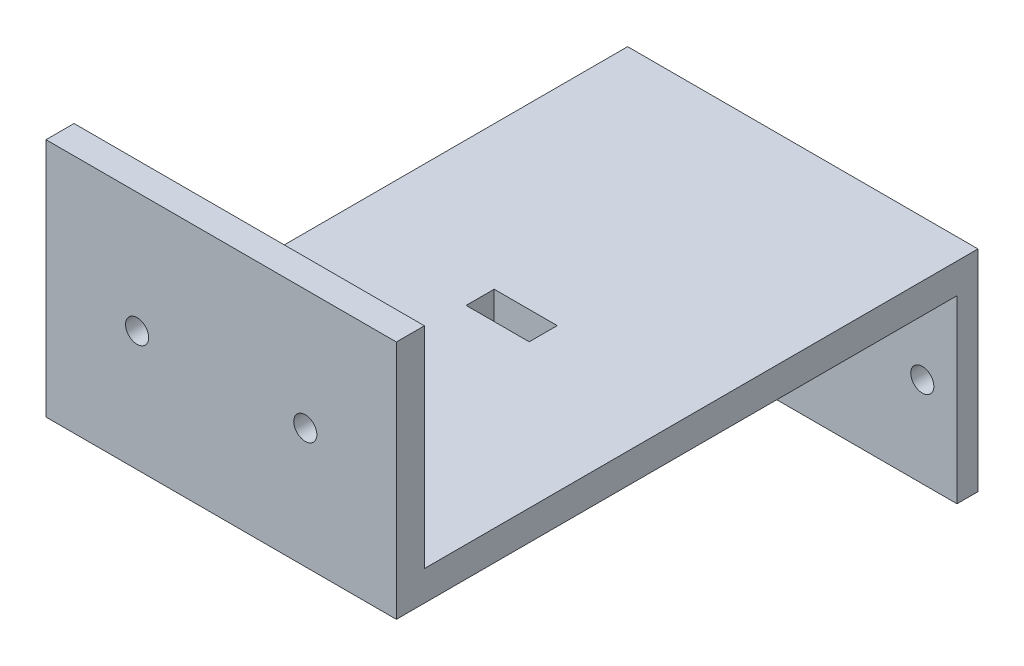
ISO-10303-21;
HEADER;
FILE_DESCRIPTION(('STEP AP214'),'2;1');
FILE_NAME('part.step','',(''),(''),'','','');
FILE_SCHEMA(('AUTOMOTIVE_DESIGN { 1 0 10303 214 1 1 1 1 }'));
ENDSEC;
DATA;
#1=APPLICATION_CONTEXT('core data for automotive mechanical design processes');
#2=APPLICATION_PROTOCOL_DEFINITION('international standard','automotive_design',2000,#1);
#3=PRODUCT_CONTEXT('',#1,'mechanical');
#4=PRODUCT('Part','Part','',(#3));
#5=PRODUCT_RELATED_PRODUCT_CATEGORY('part','',(#4));
#6=PRODUCT_DEFINITION_FORMATION('','',#4);
#7=PRODUCT_DEFINITION_CONTEXT('part definition',#1,'design');
#8=PRODUCT_DEFINITION('design','',#6,#7);
#9=PRODUCT_DEFINITION_SHAPE('','',#8);
#10=(LENGTH_UNIT() NAMED_UNIT(*) SI_UNIT(.MILLI.,.METRE.));
#11=(NAMED_UNIT(*) PLANE_ANGLE_UNIT() SI_UNIT($,.RADIAN.));
#12=(NAMED_UNIT(*) SI_UNIT($,.STERADIAN.) SOLID_ANGLE_UNIT());
#13=UNCERTAINTY_MEASURE_WITH_UNIT(LENGTH_MEASURE(1.E-05),#10,'distance_accuracy_value','');
#14=(GEOMETRIC_REPRESENTATION_CONTEXT(3) GLOBAL_UNCERTAINTY_ASSIGNED_CONTEXT((#13)) GLOBAL_UNIT_ASSIGNED_CONTEXT((#10,
#11,#12)) REPRESENTATION_CONTEXT('',''));
#15=CARTESIAN_POINT('',(0.,0.,0.));
#16=DIRECTION('',(0.,0.,1.));
#17=DIRECTION('',(1.,0.,0.));
#18=AXIS2_PLACEMENT_3D('',#15,#16,#17);
#19=CARTESIAN_POINT('',(-50.,30.,3.));
#20=DIRECTION('',(0.,-1.,0.));
#21=DIRECTION('',(0.,0.,-1.));
#22=AXIS2_PLACEMENT_3D('',#19,#20,#21);
#23=PLANE('',#22);
#24=DIRECTION('',(0.,0.,1.));
#25=VECTOR('',#24,1.);
#26=CARTESIAN_POINT('',(-29.5438540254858,30.,3.));
#27=LINE('',#26,#25);
#28=CARTESIAN_POINT('',(-29.5438540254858,30.,39.5));
#29=VERTEX_POINT('',#28);
#30=CARTESIAN_POINT('',(-29.5438540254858,30.,43.5));
#31=VERTEX_POINT('',#30);
#32=EDGE_CURVE('E238',#29,#31,#27,.T.);
#33=ORIENTED_EDGE('',*,*,#32,.F.);
#34=DIRECTION('',(-1.,0.,0.));
#35=VECTOR('',#34,1.);
#36=CARTESIAN_POINT('',(-50.,30.,39.5));
#37=LINE('',#36,#35);
#38=CARTESIAN_POINT('',(-20.5438540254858,30.,39.5));
#39=VERTEX_POINT('',#38);
#40=EDGE_CURVE('E195',#39,#29,#37,.T.);
#41=ORIENTED_EDGE('',*,*,#40,.F.);
#42=DIRECTION('',(0.,0.,1.));
#43=VECTOR('',#42,1.);
#44=CARTESIAN_POINT('',(-20.5438540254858,30.,3.));
#45=LINE('',#44,#43);
#46=CARTESIAN_POINT('',(-20.5438540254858,30.,43.5));
#47=VERTEX_POINT('',#46);
#48=EDGE_CURVE('E230',#39,#47,#45,.T.);
#49=ORIENTED_EDGE('',*,*,#48,.T.);
#50=DIRECTION('',(-1.,0.,0.));
#51=VECTOR('',#50,1.);
#52=CARTESIAN_POINT('',(-50.,30.,43.5));
#53=LINE('',#52,#51);
#54=EDGE_CURVE('E234',#47,#31,#53,.T.);
#55=ORIENTED_EDGE('',*,*,#54,.T.);
#56=EDGE_LOOP('',(#33,#41,#49,#55));
#57=FACE_BOUND('',#56,.T.);
#58=DIRECTION('',(-1.,0.,0.));
#59=VECTOR('',#58,1.);
#60=CARTESIAN_POINT('',(0.,30.,79.));
#61=LINE('',#60,#59);
#62=CARTESIAN_POINT('',(0.,30.,79.));
#63=VERTEX_POINT('',#62);
#64=CARTESIAN_POINT('',(-50.,30.,79.));
#65=VERTEX_POINT('',#64);
#66=EDGE_CURVE('E274',#63,#65,#61,.T.);
#67=ORIENTED_EDGE('',*,*,#66,.F.);
#68=DIRECTION('',(0.,0.,-1.));
#69=VECTOR('',#68,1.);
#70=CARTESIAN_POINT('',(0.,30.,3.));
#71=LINE('',#70,#69);
#72=CARTESIAN_POINT('',(0.,30.,0.));
#73=VERTEX_POINT('',#72);
#74=EDGE_CURVE('E11',#63,#73,#71,.T.);
#75=ORIENTED_EDGE('',*,*,#74,.T.);
#76=DIRECTION('',(-1.,0.,0.));
#77=VECTOR('',#76,1.);
#78=CARTESIAN_POINT('',(-50.,30.,0.));
#79=LINE('',#78,#77);
#80=CARTESIAN_POINT('',(-50.,30.,0.));
#81=VERTEX_POINT('',#80);
#82=EDGE_CURVE('E333',#73,#81,#79,.T.);
#83=ORIENTED_EDGE('',*,*,#82,.T.);
#84=DIRECTION('',(0.,0.,-1.));
#85=VECTOR('',#84,1.);
#86=CARTESIAN_POINT('',(-50.,30.,3.));
#87=LINE('',#86,#85);
#88=EDGE_CURVE('E55',#65,#81,#87,.T.);
#89=ORIENTED_EDGE('',*,*,#88,.F.);
#90=EDGE_LOOP('',(#67,#75,#83,#89));
#91=FACE_BOUND('',#90,.T.);
#92=DIRECTION('',(0.,0.,-1.));
#93=VECTOR('',#92,1.);
#94=CARTESIAN_POINT('',(-20.5438540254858,30.,3.));
#95=LINE('',#94,#93);
#96=CARTESIAN_POINT('',(-20.5438540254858,30.,74.338050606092));
#97=VERTEX_POINT('',#96);
#98=CARTESIAN_POINT('',(-20.5438540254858,30.,70.338050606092));
#99=VERTEX_POINT('',#98);
#100=EDGE_CURVE('E249',#97,#99,#95,.T.);
#101=ORIENTED_EDGE('',*,*,#100,.F.);
#102=DIRECTION('',(1.,0.,0.));
#103=VECTOR('',#102,1.);
#104=CARTESIAN_POINT('',(-50.,30.,74.338050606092));
#105=LINE('',#104,#103);
#106=CARTESIAN_POINT('',(-29.5438540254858,30.,74.338050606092));
#107=VERTEX_POINT('',#106);
#108=EDGE_CURVE('E240',#107,#97,#105,.T.);
#109=ORIENTED_EDGE('',*,*,#108,.F.);
#110=DIRECTION('',(0.,0.,-1.));
#111=VECTOR('',#110,1.);
#112=CARTESIAN_POINT('',(-29.5438540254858,30.,3.));
#113=LINE('',#112,#111);
#114=CARTESIAN_POINT('',(-29.5438540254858,30.,70.338050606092));
#115=VERTEX_POINT('',#114);
#116=EDGE_CURVE('E165',#107,#115,#113,.T.);
#117=ORIENTED_EDGE('',*,*,#116,.T.);
#118=DIRECTION('',(1.,0.,0.));
#119=VECTOR('',#118,1.);
#120=CARTESIAN_POINT('',(-50.,30.,70.338050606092));
#121=LINE('',#120,#119);
#122=EDGE_CURVE('E245',#115,#99,#121,.T.);
#123=ORIENTED_EDGE('',*,*,#122,.T.);
#124=EDGE_LOOP('',(#101,#109,#117,#123));
#125=FACE_BOUND('',#124,.T.);
#126=ADVANCED_FACE('F45',(#57,#91,#125),#23,.F.);
#127=CARTESIAN_POINT('',(0.,25.717337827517,83.));
#128=DIRECTION('',(0.,1.,0.));
#129=DIRECTION('',(0.,0.,1.));
#130=AXIS2_PLACEMENT_3D('',#127,#128,#129);
#131=PLANE('',#130);
#132=DIRECTION('',(0.,0.,1.));
#133=VECTOR('',#132,1.);
#134=CARTESIAN_POINT('',(-29.5438540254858,25.717337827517,0.));
#135=LINE('',#134,#133);
#136=CARTESIAN_POINT('',(-29.5438540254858,25.717337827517,39.5));
#137=VERTEX_POINT('',#136);
#138=CARTESIAN_POINT('',(-29.5438540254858,25.717337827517,43.5));
#139=VERTEX_POINT('',#138);
#140=EDGE_CURVE('E200',#137,#139,#135,.T.);
#141=ORIENTED_EDGE('',*,*,#140,.T.);
#142=DIRECTION('',(-1.,0.,0.));
#143=VECTOR('',#142,1.);
#144=CARTESIAN_POINT('',(0.,25.717337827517,43.5));
#145=LINE('',#144,#143);
#146=CARTESIAN_POINT('',(-20.5438540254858,25.717337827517,43.5));
#147=VERTEX_POINT('',#146);
#148=EDGE_CURVE('E212',#147,#139,#145,.T.);
#149=ORIENTED_EDGE('',*,*,#148,.F.);
#150=DIRECTION('',(0.,0.,1.));
#151=VECTOR('',#150,1.);
#152=CARTESIAN_POINT('',(-20.5438540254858,25.717337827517,0.));
#153=LINE('',#152,#151);
#154=CARTESIAN_POINT('',(-20.5438540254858,25.717337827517,39.5));
#155=VERTEX_POINT('',#154);
#156=EDGE_CURVE('E208',#155,#147,#153,.T.);
#157=ORIENTED_EDGE('',*,*,#156,.F.);
#158=DIRECTION('',(-1.,0.,0.));
#159=VECTOR('',#158,1.);
#160=CARTESIAN_POINT('',(0.,25.717337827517,39.5));
#161=LINE('',#160,#159);
#162=EDGE_CURVE('E204',#155,#137,#161,.T.);
#163=ORIENTED_EDGE('',*,*,#162,.T.);
#164=EDGE_LOOP('',(#141,#149,#157,#163));
#165=FACE_BOUND('',#164,.T.);
#166=DIRECTION('',(1.,0.,0.));
#167=VECTOR('',#166,1.);
#168=CARTESIAN_POINT('',(0.,25.717337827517,3.));
#169=LINE('',#168,#167);
#170=CARTESIAN_POINT('',(-50.,25.717337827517,3.));
#171=VERTEX_POINT('',#170);
#172=CARTESIAN_POINT('',(0.,25.717337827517,3.));
#173=VERTEX_POINT('',#172);
#174=EDGE_CURVE('E296',#171,#173,#169,.T.);
#175=ORIENTED_EDGE('',*,*,#174,.T.);
#176=DIRECTION('',(0.,0.,-1.));
#177=VECTOR('',#176,1.);
#178=CARTESIAN_POINT('',(0.,25.717337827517,83.));
#179=LINE('',#178,#177);
#180=CARTESIAN_POINT('',(0.,25.717337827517,83.));
#181=VERTEX_POINT('',#180);
#182=EDGE_CURVE('E307',#181,#173,#179,.T.);
#183=ORIENTED_EDGE('',*,*,#182,.F.);
#184=DIRECTION('',(1.,0.,0.));
#185=VECTOR('',#184,1.);
#186=CARTESIAN_POINT('',(0.,25.717337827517,83.));
#187=LINE('',#186,#185);
#188=CARTESIAN_POINT('',(-50.,25.717337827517,83.));
#189=VERTEX_POINT('',#188);
#190=EDGE_CURVE('E301',#189,#181,#187,.T.);
#191=ORIENTED_EDGE('',*,*,#190,.F.);
#192=DIRECTION('',(0.,0.,-1.));
#193=VECTOR('',#192,1.);
#194=CARTESIAN_POINT('',(-50.,25.717337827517,83.));
#195=LINE('',#194,#193);
#196=EDGE_CURVE('E314',#189,#171,#195,.T.);
#197=ORIENTED_EDGE('',*,*,#196,.T.);
#198=EDGE_LOOP('',(#175,#183,#191,#197));
#199=FACE_BOUND('',#198,.T.);
#200=DIRECTION('',(0.,0.,-1.));
#201=VECTOR('',#200,1.);
#202=CARTESIAN_POINT('',(-20.5438540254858,25.717337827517,0.));
#203=LINE('',#202,#201);
#204=CARTESIAN_POINT('',(-20.5438540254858,25.717337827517,74.338050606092));
#205=VERTEX_POINT('',#204);
#206=CARTESIAN_POINT('',(-20.5438540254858,25.717337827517,70.338050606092));
#207=VERTEX_POINT('',#206);
#208=EDGE_CURVE('E179',#205,#207,#203,.T.);
#209=ORIENTED_EDGE('',*,*,#208,.T.);
#210=DIRECTION('',(1.,0.,0.));
#211=VECTOR('',#210,1.);
#212=CARTESIAN_POINT('',(0.,25.717337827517,70.338050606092));
#213=LINE('',#212,#211);
#214=CARTESIAN_POINT('',(-29.5438540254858,25.717337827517,70.338050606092));
#215=VERTEX_POINT('',#214);
#216=EDGE_CURVE('E183',#215,#207,#213,.T.);
#217=ORIENTED_EDGE('',*,*,#216,.F.);
#218=DIRECTION('',(0.,0.,-1.));
#219=VECTOR('',#218,1.);
#220=CARTESIAN_POINT('',(-29.5438540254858,25.717337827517,0.));
#221=LINE('',#220,#219);
#222=CARTESIAN_POINT('',(-29.5438540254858,25.717337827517,74.338050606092));
#223=VERTEX_POINT('',#222);
#224=EDGE_CURVE('E162',#223,#215,#221,.T.);
#225=ORIENTED_EDGE('',*,*,#224,.F.);
#226=DIRECTION('',(1.,0.,0.));
#227=VECTOR('',#226,1.);
#228=CARTESIAN_POINT('',(0.,25.717337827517,74.338050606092));
#229=LINE('',#228,#227);
#230=EDGE_CURVE('E173',#223,#205,#229,.T.);
#231=ORIENTED_EDGE('',*,*,#230,.T.);
#232=EDGE_LOOP('',(#209,#217,#225,#231));
#233=FACE_BOUND('',#232,.T.);
#234=ADVANCED_FACE('F181',(#165,#199,#233),#131,.F.);
#235=CARTESIAN_POINT('',(0.,0.,3.));
#236=DIRECTION('',(0.,0.,-1.));
#237=DIRECTION('',(-1.,0.,0.));
#238=AXIS2_PLACEMENT_3D('',#235,#236,#237);
#239=PLANE('',#238);
#240=CARTESIAN_POINT('',(-45.05,12.8586689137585,3.));
#241=DIRECTION('',(0.,0.,1.));
#242=DIRECTION('',(1.,0.,0.));
#243=AXIS2_PLACEMENT_3D('',#240,#241,#242);
#244=CIRCLE('',#243,1.65);
#245=CARTESIAN_POINT('',(-43.4,12.8586689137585,3.));
#246=VERTEX_POINT('',#245);
#247=EDGE_CURVE('E260',#246,#246,#244,.T.);
#248=ORIENTED_EDGE('',*,*,#247,.F.);
#249=EDGE_LOOP('',(#248));
#250=FACE_BOUND('',#249,.T.);
#251=CARTESIAN_POINT('',(-4.95,12.8586689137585,3.));
#252=DIRECTION('',(0.,0.,1.));
#253=DIRECTION('',(-1.,0.,0.));
#254=AXIS2_PLACEMENT_3D('',#251,#252,#253);
#255=CIRCLE('',#254,1.65);
#256=CARTESIAN_POINT('',(-6.6,12.8586689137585,3.));
#257=VERTEX_POINT('',#256);
#258=EDGE_CURVE('E265',#257,#257,#255,.T.);
#259=ORIENTED_EDGE('',*,*,#258,.F.);
#260=EDGE_LOOP('',(#259));
#261=FACE_BOUND('',#260,.T.);
#262=ORIENTED_EDGE('',*,*,#174,.F.);
#263=DIRECTION('',(0.,-1.,0.));
#264=VECTOR('',#263,1.);
#265=CARTESIAN_POINT('',(-50.,0.,3.));
#266=LINE('',#265,#264);
#267=CARTESIAN_POINT('',(-50.,0.,3.));
#268=VERTEX_POINT('',#267);
#269=EDGE_CURVE('E322',#171,#268,#266,.T.);
#270=ORIENTED_EDGE('',*,*,#269,.T.);
#271=DIRECTION('',(1.,0.,0.));
#272=VECTOR('',#271,1.);
#273=CARTESIAN_POINT('',(0.,0.,3.));
#274=LINE('',#273,#272);
#275=CARTESIAN_POINT('',(0.,0.,3.));
#276=VERTEX_POINT('',#275);
#277=EDGE_CURVE('E326',#268,#276,#274,.T.);
#278=ORIENTED_EDGE('',*,*,#277,.T.);
#279=DIRECTION('',(0.,1.,0.));
#280=VECTOR('',#279,1.);
#281=CARTESIAN_POINT('',(0.,30.,3.));
#282=LINE('',#281,#280);
#283=EDGE_CURVE('E319',#276,#173,#282,.T.);
#284=ORIENTED_EDGE('',*,*,#283,.T.);
#285=EDGE_LOOP('',(#262,#270,#278,#284));
#286=FACE_BOUND('',#285,.T.);
#287=ADVANCED_FACE('F385',(#250,#261,#286),#239,.F.);
#288=CARTESIAN_POINT('',(0.,30.,3.));
#289=DIRECTION('',(-1.,0.,0.));
#290=DIRECTION('',(0.,0.,1.));
#291=AXIS2_PLACEMENT_3D('',#288,#289,#290);
#292=PLANE('',#291);
#293=DIRECTION('',(0.,1.,0.));
#294=VECTOR('',#293,1.);
#295=CARTESIAN_POINT('',(0.,30.,0.));
#296=LINE('',#295,#294);
#297=CARTESIAN_POINT('',(0.,0.,0.));
#298=VERTEX_POINT('',#297);
#299=EDGE_CURVE('E318',#298,#73,#296,.T.);
#300=ORIENTED_EDGE('',*,*,#299,.T.);
#301=ORIENTED_EDGE('',*,*,#74,.F.);
#302=DIRECTION('',(0.,-1.,0.));
#303=VECTOR('',#302,1.);
#304=CARTESIAN_POINT('',(0.,60.,79.));
#305=LINE('',#304,#303);
#306=CARTESIAN_POINT('',(0.,60.,79.));
#307=VERTEX_POINT('',#306);
#308=EDGE_CURVE('E292',#307,#63,#305,.T.);
#309=ORIENTED_EDGE('',*,*,#308,.F.);
#310=DIRECTION('',(0.,0.,-1.));
#311=VECTOR('',#310,1.);
#312=CARTESIAN_POINT('',(0.,60.,83.));
#313=LINE('',#312,#311);
#314=CARTESIAN_POINT('',(0.,60.,83.));
#315=VERTEX_POINT('',#314);
#316=EDGE_CURVE('E278',#315,#307,#313,.T.);
#317=ORIENTED_EDGE('',*,*,#316,.F.);
#318=DIRECTION('',(0.,1.,0.));
#319=VECTOR('',#318,1.);
#320=CARTESIAN_POINT('',(0.,30.,83.));
#321=LINE('',#320,#319);
#322=EDGE_CURVE('E304',#181,#315,#321,.T.);
#323=ORIENTED_EDGE('',*,*,#322,.F.);
#324=ORIENTED_EDGE('',*,*,#182,.T.);
#325=ORIENTED_EDGE('',*,*,#283,.F.);
#326=DIRECTION('',(0.,0.,-1.));
#327=VECTOR('',#326,1.);
#328=CARTESIAN_POINT('',(0.,0.,3.));
#329=LINE('',#328,#327);
#330=EDGE_CURVE('E329',#276,#298,#329,.T.);
#331=ORIENTED_EDGE('',*,*,#330,.T.);
#332=EDGE_LOOP('',(#300,#301,#309,#317,#323,#324,#325,#331));
#333=FACE_BOUND('',#332,.T.);
#334=ADVANCED_FACE('F47',(#333),#292,.F.);
#335=CARTESIAN_POINT('',(-50.,0.,3.));
#336=DIRECTION('',(1.,0.,0.));
#337=DIRECTION('',(0.,0.,-1.));
#338=AXIS2_PLACEMENT_3D('',#335,#336,#337);
#339=PLANE('',#338);
#340=DIRECTION('',(0.,-1.,0.));
#341=VECTOR('',#340,1.);
#342=CARTESIAN_POINT('',(-50.,0.,0.));
#343=LINE('',#342,#341);
#344=CARTESIAN_POINT('',(-50.,0.,0.));
#345=VERTEX_POINT('',#344);
#346=EDGE_CURVE('E337',#81,#345,#343,.T.);
#347=ORIENTED_EDGE('',*,*,#346,.T.);
#348=DIRECTION('',(0.,0.,-1.));
#349=VECTOR('',#348,1.);
#350=CARTESIAN_POINT('',(-50.,0.,3.));
#351=LINE('',#350,#349);
#352=EDGE_CURVE('E345',#268,#345,#351,.T.);
#353=ORIENTED_EDGE('',*,*,#352,.F.);
#354=ORIENTED_EDGE('',*,*,#269,.F.);
#355=ORIENTED_EDGE('',*,*,#196,.F.);
#356=DIRECTION('',(0.,-1.,0.));
#357=VECTOR('',#356,1.);
#358=CARTESIAN_POINT('',(-50.,25.717337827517,83.));
#359=LINE('',#358,#357);
#360=CARTESIAN_POINT('',(-50.,60.,83.));
#361=VERTEX_POINT('',#360);
#362=EDGE_CURVE('E297',#361,#189,#359,.T.);
#363=ORIENTED_EDGE('',*,*,#362,.F.);
#364=DIRECTION('',(0.,0.,1.));
#365=VECTOR('',#364,1.);
#366=CARTESIAN_POINT('',(-50.,60.,79.));
#367=LINE('',#366,#365);
#368=CARTESIAN_POINT('',(-50.,60.,79.));
#369=VERTEX_POINT('',#368);
#370=EDGE_CURVE('E269',#369,#361,#367,.T.);
#371=ORIENTED_EDGE('',*,*,#370,.F.);
#372=DIRECTION('',(0.,-1.,0.));
#373=VECTOR('',#372,1.);
#374=CARTESIAN_POINT('',(-50.,60.,79.));
#375=LINE('',#374,#373);
#376=EDGE_CURVE('E284',#369,#65,#375,.T.);
#377=ORIENTED_EDGE('',*,*,#376,.T.);
#378=ORIENTED_EDGE('',*,*,#88,.T.);
#379=EDGE_LOOP('',(#347,#353,#354,#355,#363,#371,#377,#378));
#380=FACE_BOUND('',#379,.T.);
#381=ADVANCED_FACE('F391',(#380),#339,.F.);
#382=CARTESIAN_POINT('',(0.,0.,3.));
#383=DIRECTION('',(0.,1.,0.));
#384=DIRECTION('',(0.,0.,1.));
#385=AXIS2_PLACEMENT_3D('',#382,#383,#384);
#386=PLANE('',#385);
#387=DIRECTION('',(1.,0.,0.));
#388=VECTOR('',#387,1.);
#389=CARTESIAN_POINT('',(0.,0.,0.));
#390=LINE('',#389,#388);
#391=EDGE_CURVE('E323',#345,#298,#390,.T.);
#392=ORIENTED_EDGE('',*,*,#391,.T.);
#393=ORIENTED_EDGE('',*,*,#330,.F.);
#394=ORIENTED_EDGE('',*,*,#277,.F.);
#395=ORIENTED_EDGE('',*,*,#352,.T.);
#396=EDGE_LOOP('',(#392,#393,#394,#395));
#397=FACE_BOUND('',#396,.T.);
#398=ADVANCED_FACE('F394',(#397),#386,.F.);
#399=CARTESIAN_POINT('',(0.,0.,0.));
#400=DIRECTION('',(0.,0.,-1.));
#401=DIRECTION('',(-1.,0.,0.));
#402=AXIS2_PLACEMENT_3D('',#399,#400,#401);
#403=PLANE('',#402);
#404=CARTESIAN_POINT('',(-45.05,12.8586689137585,0.));
#405=DIRECTION('',(0.,0.,-1.));
#406=DIRECTION('',(-1.,0.,0.));
#407=AXIS2_PLACEMENT_3D('',#404,#405,#406);
#408=CIRCLE('',#407,1.65);
#409=CARTESIAN_POINT('',(-46.7,12.8586689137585,0.));
#410=VERTEX_POINT('',#409);
#411=EDGE_CURVE('E288',#410,#410,#408,.T.);
#412=ORIENTED_EDGE('',*,*,#411,.F.);
#413=EDGE_LOOP('',(#412));
#414=FACE_BOUND('',#413,.T.);
#415=CARTESIAN_POINT('',(-4.95,12.8586689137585,0.));
#416=DIRECTION('',(0.,0.,-1.));
#417=DIRECTION('',(-1.,0.,0.));
#418=AXIS2_PLACEMENT_3D('',#415,#416,#417);
#419=CIRCLE('',#418,1.65);
#420=CARTESIAN_POINT('',(-6.6,12.8586689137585,0.));
#421=VERTEX_POINT('',#420);
#422=EDGE_CURVE('E264',#421,#421,#419,.T.);
#423=ORIENTED_EDGE('',*,*,#422,.F.);
#424=EDGE_LOOP('',(#423));
#425=FACE_BOUND('',#424,.T.);
#426=ORIENTED_EDGE('',*,*,#299,.F.);
#427=ORIENTED_EDGE('',*,*,#391,.F.);
#428=ORIENTED_EDGE('',*,*,#346,.F.);
#429=ORIENTED_EDGE('',*,*,#82,.F.);
#430=EDGE_LOOP('',(#426,#427,#428,#429));
#431=FACE_BOUND('',#430,.T.);
#432=ADVANCED_FACE('F398',(#414,#425,#431),#403,.T.);
#433=CARTESIAN_POINT('',(0.,0.,83.));
#434=DIRECTION('',(0.,0.,-1.));
#435=DIRECTION('',(-1.,0.,0.));
#436=AXIS2_PLACEMENT_3D('',#433,#434,#435);
#437=PLANE('',#436);
#438=CARTESIAN_POINT('',(-37.,42.8586689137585,83.));
#439=DIRECTION('',(0.,0.,1.));
#440=DIRECTION('',(1.,0.,0.));
#441=AXIS2_PLACEMENT_3D('',#438,#439,#440);
#442=CIRCLE('',#441,1.65);
#443=CARTESIAN_POINT('',(-35.35,42.8586689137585,83.));
#444=VERTEX_POINT('',#443);
#445=EDGE_CURVE('E252',#444,#444,#442,.T.);
#446=ORIENTED_EDGE('',*,*,#445,.F.);
#447=EDGE_LOOP('',(#446));
#448=FACE_BOUND('',#447,.T.);
#449=CARTESIAN_POINT('',(-13.,42.8586689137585,83.));
#450=DIRECTION('',(0.,0.,1.));
#451=DIRECTION('',(-1.,0.,0.));
#452=AXIS2_PLACEMENT_3D('',#449,#450,#451);
#453=CIRCLE('',#452,1.65);
#454=CARTESIAN_POINT('',(-14.65,42.8586689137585,83.));
#455=VERTEX_POINT('',#454);
#456=EDGE_CURVE('E251',#455,#455,#453,.T.);
#457=ORIENTED_EDGE('',*,*,#456,.F.);
#458=EDGE_LOOP('',(#457));
#459=FACE_BOUND('',#458,.T.);
#460=ORIENTED_EDGE('',*,*,#362,.T.);
#461=ORIENTED_EDGE('',*,*,#190,.T.);
#462=ORIENTED_EDGE('',*,*,#322,.T.);
#463=DIRECTION('',(1.,0.,0.));
#464=VECTOR('',#463,1.);
#465=CARTESIAN_POINT('',(-50.,60.,83.));
#466=LINE('',#465,#464);
#467=EDGE_CURVE('E273',#361,#315,#466,.T.);
#468=ORIENTED_EDGE('',*,*,#467,.F.);
#469=EDGE_LOOP('',(#460,#461,#462,#468));
#470=FACE_BOUND('',#469,.T.);
#471=ADVANCED_FACE('F402',(#448,#459,#470),#437,.F.);
#472=CARTESIAN_POINT('',(0.,60.,79.));
#473=DIRECTION('',(0.,0.,1.));
#474=DIRECTION('',(1.,0.,0.));
#475=AXIS2_PLACEMENT_3D('',#472,#473,#474);
#476=PLANE('',#475);
#477=CARTESIAN_POINT('',(-37.,42.8586689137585,79.));
#478=DIRECTION('',(0.,0.,1.));
#479=DIRECTION('',(1.,0.,0.));
#480=AXIS2_PLACEMENT_3D('',#477,#478,#479);
#481=CIRCLE('',#480,1.65);
#482=CARTESIAN_POINT('',(-35.35,42.8586689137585,79.));
#483=VERTEX_POINT('',#482);
#484=EDGE_CURVE('E49',#483,#483,#481,.T.);
#485=ORIENTED_EDGE('',*,*,#484,.T.);
#486=EDGE_LOOP('',(#485));
#487=FACE_BOUND('',#486,.T.);
#488=CARTESIAN_POINT('',(-13.,42.8586689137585,79.));
#489=DIRECTION('',(0.,0.,1.));
#490=DIRECTION('',(1.,0.,0.));
#491=AXIS2_PLACEMENT_3D('',#488,#489,#490);
#492=CIRCLE('',#491,1.65);
#493=CARTESIAN_POINT('',(-11.35,42.8586689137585,79.));
#494=VERTEX_POINT('',#493);
#495=EDGE_CURVE('E256',#494,#494,#492,.T.);
#496=ORIENTED_EDGE('',*,*,#495,.T.);
#497=EDGE_LOOP('',(#496));
#498=FACE_BOUND('',#497,.T.);
#499=ORIENTED_EDGE('',*,*,#66,.T.);
#500=ORIENTED_EDGE('',*,*,#376,.F.);
#501=DIRECTION('',(-1.,0.,0.));
#502=VECTOR('',#501,1.);
#503=CARTESIAN_POINT('',(0.,60.,79.));
#504=LINE('',#503,#502);
#505=EDGE_CURVE('E281',#307,#369,#504,.T.);
#506=ORIENTED_EDGE('',*,*,#505,.F.);
#507=ORIENTED_EDGE('',*,*,#308,.T.);
#508=EDGE_LOOP('',(#499,#500,#506,#507));
#509=FACE_BOUND('',#508,.T.);
#510=ADVANCED_FACE('F364',(#487,#498,#509),#476,.F.);
#511=CARTESIAN_POINT('',(0.,60.,0.));
#512=DIRECTION('',(0.,1.,0.));
#513=DIRECTION('',(0.,0.,1.));
#514=AXIS2_PLACEMENT_3D('',#511,#512,#513);
#515=PLANE('',#514);
#516=ORIENTED_EDGE('',*,*,#370,.T.);
#517=ORIENTED_EDGE('',*,*,#467,.T.);
#518=ORIENTED_EDGE('',*,*,#316,.T.);
#519=ORIENTED_EDGE('',*,*,#505,.T.);
#520=EDGE_LOOP('',(#516,#517,#518,#519));
#521=FACE_BOUND('',#520,.T.);
#522=ADVANCED_FACE('F412',(#521),#515,.T.);
#523=CARTESIAN_POINT('',(-4.95,12.8586689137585,-27.));
#524=DIRECTION('',(0.,0.,1.));
#525=DIRECTION('',(1.,0.,0.));
#526=AXIS2_PLACEMENT_3D('',#523,#524,#525);
#527=CYLINDRICAL_SURFACE('',#526,1.65);
#528=ORIENTED_EDGE('',*,*,#422,.T.);
#529=EDGE_LOOP('',(#528));
#530=FACE_BOUND('',#529,.T.);
#531=ORIENTED_EDGE('',*,*,#258,.T.);
#532=EDGE_LOOP('',(#531));
#533=FACE_BOUND('',#532,.T.);
#534=ADVANCED_FACE('F415',(#530,#533),#527,.F.);
#535=CARTESIAN_POINT('',(-45.05,12.8586689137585,-27.));
#536=DIRECTION('',(0.,0.,1.));
#537=DIRECTION('',(1.,0.,0.));
#538=AXIS2_PLACEMENT_3D('',#535,#536,#537);
#539=CYLINDRICAL_SURFACE('',#538,1.65);
#540=ORIENTED_EDGE('',*,*,#411,.T.);
#541=EDGE_LOOP('',(#540));
#542=FACE_BOUND('',#541,.T.);
#543=ORIENTED_EDGE('',*,*,#247,.T.);
#544=EDGE_LOOP('',(#543));
#545=FACE_BOUND('',#544,.T.);
#546=ADVANCED_FACE('F378',(#542,#545),#539,.F.);
#547=CARTESIAN_POINT('',(-13.,42.8586689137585,53.));
#548=DIRECTION('',(0.,0.,1.));
#549=DIRECTION('',(1.,0.,0.));
#550=AXIS2_PLACEMENT_3D('',#547,#548,#549);
#551=CYLINDRICAL_SURFACE('',#550,1.65);
#552=ORIENTED_EDGE('',*,*,#456,.T.);
#553=EDGE_LOOP('',(#552));
#554=FACE_BOUND('',#553,.T.);
#555=ORIENTED_EDGE('',*,*,#495,.F.);
#556=EDGE_LOOP('',(#555));
#557=FACE_BOUND('',#556,.T.);
#558=ADVANCED_FACE('F369',(#554,#557),#551,.F.);
#559=CARTESIAN_POINT('',(-37.,42.8586689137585,53.));
#560=DIRECTION('',(0.,0.,1.));
#561=DIRECTION('',(1.,0.,0.));
#562=AXIS2_PLACEMENT_3D('',#559,#560,#561);
#563=CYLINDRICAL_SURFACE('',#562,1.65);
#564=ORIENTED_EDGE('',*,*,#445,.T.);
#565=EDGE_LOOP('',(#564));
#566=FACE_BOUND('',#565,.T.);
#567=ORIENTED_EDGE('',*,*,#484,.F.);
#568=EDGE_LOOP('',(#567));
#569=FACE_BOUND('',#568,.T.);
#570=ADVANCED_FACE('F366',(#566,#569),#563,.F.);
#571=CARTESIAN_POINT('',(-29.5438540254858,35.717337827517,0.));
#572=DIRECTION('',(1.,0.,0.));
#573=DIRECTION('',(0.,0.,-1.));
#574=AXIS2_PLACEMENT_3D('',#571,#572,#573);
#575=PLANE('',#574);
#576=ORIENTED_EDGE('',*,*,#32,.T.);
#577=DIRECTION('',(0.,-1.,0.));
#578=VECTOR('',#577,1.);
#579=CARTESIAN_POINT('',(-29.5438540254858,35.717337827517,43.5));
#580=LINE('',#579,#578);
#581=EDGE_CURVE('E217',#31,#139,#580,.T.);
#582=ORIENTED_EDGE('',*,*,#581,.T.);
#583=ORIENTED_EDGE('',*,*,#140,.F.);
#584=DIRECTION('',(0.,-1.,0.));
#585=VECTOR('',#584,1.);
#586=CARTESIAN_POINT('',(-29.5438540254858,35.717337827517,39.5));
#587=LINE('',#586,#585);
#588=EDGE_CURVE('E216',#29,#137,#587,.T.);
#589=ORIENTED_EDGE('',*,*,#588,.F.);
#590=EDGE_LOOP('',(#576,#582,#583,#589));
#591=FACE_BOUND('',#590,.T.);
#592=ADVANCED_FACE('F368',(#591),#575,.T.);
#593=CARTESIAN_POINT('',(0.,35.717337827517,43.5));
#594=DIRECTION('',(0.,0.,1.));
#595=DIRECTION('',(1.,0.,0.));
#596=AXIS2_PLACEMENT_3D('',#593,#594,#595);
#597=PLANE('',#596);
#598=DIRECTION('',(0.,-1.,0.));
#599=VECTOR('',#598,1.);
#600=CARTESIAN_POINT('',(-20.5438540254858,35.717337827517,43.5));
#601=LINE('',#600,#599);
#602=EDGE_CURVE('E220',#47,#147,#601,.T.);
#603=ORIENTED_EDGE('',*,*,#602,.T.);
#604=ORIENTED_EDGE('',*,*,#148,.T.);
#605=ORIENTED_EDGE('',*,*,#581,.F.);
#606=ORIENTED_EDGE('',*,*,#54,.F.);
#607=EDGE_LOOP('',(#603,#604,#605,#606));
#608=FACE_BOUND('',#607,.T.);
#609=ADVANCED_FACE('F375',(#608),#597,.F.);
#610=CARTESIAN_POINT('',(-20.5438540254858,35.717337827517,0.));
#611=DIRECTION('',(1.,0.,0.));
#612=DIRECTION('',(0.,0.,-1.));
#613=AXIS2_PLACEMENT_3D('',#610,#611,#612);
#614=PLANE('',#613);
#615=DIRECTION('',(0.,-1.,0.));
#616=VECTOR('',#615,1.);
#617=CARTESIAN_POINT('',(-20.5438540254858,35.717337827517,39.5));
#618=LINE('',#617,#616);
#619=EDGE_CURVE('E71',#39,#155,#618,.T.);
#620=ORIENTED_EDGE('',*,*,#619,.T.);
#621=ORIENTED_EDGE('',*,*,#156,.T.);
#622=ORIENTED_EDGE('',*,*,#602,.F.);
#623=ORIENTED_EDGE('',*,*,#48,.F.);
#624=EDGE_LOOP('',(#620,#621,#622,#623));
#625=FACE_BOUND('',#624,.T.);
#626=ADVANCED_FACE('F531',(#625),#614,.F.);
#627=CARTESIAN_POINT('',(0.,35.717337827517,39.5));
#628=DIRECTION('',(0.,0.,1.));
#629=DIRECTION('',(1.,0.,0.));
#630=AXIS2_PLACEMENT_3D('',#627,#628,#629);
#631=PLANE('',#630);
#632=ORIENTED_EDGE('',*,*,#40,.T.);
#633=ORIENTED_EDGE('',*,*,#588,.T.);
#634=ORIENTED_EDGE('',*,*,#162,.F.);
#635=ORIENTED_EDGE('',*,*,#619,.F.);
#636=EDGE_LOOP('',(#632,#633,#634,#635));
#637=FACE_BOUND('',#636,.T.);
#638=ADVANCED_FACE('F542',(#637),#631,.T.);
#639=CARTESIAN_POINT('',(-20.5438540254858,35.717337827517,0.));
#640=DIRECTION('',(-1.,0.,0.));
#641=DIRECTION('',(0.,0.,1.));
#642=AXIS2_PLACEMENT_3D('',#639,#640,#641);
#643=PLANE('',#642);
#644=ORIENTED_EDGE('',*,*,#100,.T.);
#645=DIRECTION('',(0.,-1.,0.));
#646=VECTOR('',#645,1.);
#647=CARTESIAN_POINT('',(-20.5438540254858,35.717337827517,70.338050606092));
#648=LINE('',#647,#646);
#649=EDGE_CURVE('E192',#99,#207,#648,.T.);
#650=ORIENTED_EDGE('',*,*,#649,.T.);
#651=ORIENTED_EDGE('',*,*,#208,.F.);
#652=DIRECTION('',(0.,-1.,0.));
#653=VECTOR('',#652,1.);
#654=CARTESIAN_POINT('',(-20.5438540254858,35.717337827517,74.338050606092));
#655=LINE('',#654,#653);
#656=EDGE_CURVE('E169',#97,#205,#655,.T.);
#657=ORIENTED_EDGE('',*,*,#656,.F.);
#658=EDGE_LOOP('',(#644,#650,#651,#657));
#659=FACE_BOUND('',#658,.T.);
#660=ADVANCED_FACE('F553',(#659),#643,.T.);
#661=CARTESIAN_POINT('',(0.,35.717337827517,70.338050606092));
#662=DIRECTION('',(0.,0.,-1.));
#663=DIRECTION('',(-1.,0.,0.));
#664=AXIS2_PLACEMENT_3D('',#661,#662,#663);
#665=PLANE('',#664);
#666=DIRECTION('',(0.,-1.,0.));
#667=VECTOR('',#666,1.);
#668=CARTESIAN_POINT('',(-29.5438540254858,35.717337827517,70.338050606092));
#669=LINE('',#668,#667);
#670=EDGE_CURVE('E168',#115,#215,#669,.T.);
#671=ORIENTED_EDGE('',*,*,#670,.T.);
#672=ORIENTED_EDGE('',*,*,#216,.T.);
#673=ORIENTED_EDGE('',*,*,#649,.F.);
#674=ORIENTED_EDGE('',*,*,#122,.F.);
#675=EDGE_LOOP('',(#671,#672,#673,#674));
#676=FACE_BOUND('',#675,.T.);
#677=ADVANCED_FACE('F563',(#676),#665,.F.);
#678=CARTESIAN_POINT('',(-29.5438540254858,35.717337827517,0.));
#679=DIRECTION('',(-1.,0.,0.));
#680=DIRECTION('',(0.,0.,1.));
#681=AXIS2_PLACEMENT_3D('',#678,#679,#680);
#682=PLANE('',#681);
#683=DIRECTION('',(0.,-1.,0.));
#684=VECTOR('',#683,1.);
#685=CARTESIAN_POINT('',(-29.5438540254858,35.717337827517,74.338050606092));
#686=LINE('',#685,#684);
#687=EDGE_CURVE('E63',#107,#223,#686,.T.);
#688=ORIENTED_EDGE('',*,*,#687,.T.);
#689=ORIENTED_EDGE('',*,*,#224,.T.);
#690=ORIENTED_EDGE('',*,*,#670,.F.);
#691=ORIENTED_EDGE('',*,*,#116,.F.);
#692=EDGE_LOOP('',(#688,#689,#690,#691));
#693=FACE_BOUND('',#692,.T.);
#694=ADVANCED_FACE('F159',(#693),#682,.F.);
#695=CARTESIAN_POINT('',(0.,35.717337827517,74.338050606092));
#696=DIRECTION('',(0.,0.,-1.));
#697=DIRECTION('',(-1.,0.,0.));
#698=AXIS2_PLACEMENT_3D('',#695,#696,#697);
#699=PLANE('',#698);
#700=ORIENTED_EDGE('',*,*,#108,.T.);
#701=ORIENTED_EDGE('',*,*,#656,.T.);
#702=ORIENTED_EDGE('',*,*,#230,.F.);
#703=ORIENTED_EDGE('',*,*,#687,.F.);
#704=EDGE_LOOP('',(#700,#701,#702,#703));
#705=FACE_BOUND('',#704,.T.);
#706=ADVANCED_FACE('F174',(#705),#699,.T.);
#707=CLOSED_SHELL('',(#126,#234,#287,#334,#381,#398,#432,#471,#510,#522,#534,#546,#558,#570,
#592,#609,#626,#638,#660,#677,#694,#706));
#708=MANIFOLD_SOLID_BREP('B2',#707);
#709=ADVANCED_BREP_SHAPE_REPRESENTATION('',(#18,#708),#14);
#710=SHAPE_DEFINITION_REPRESENTATION(#9,#709);
ENDSEC;
END-ISO-10303-21;
